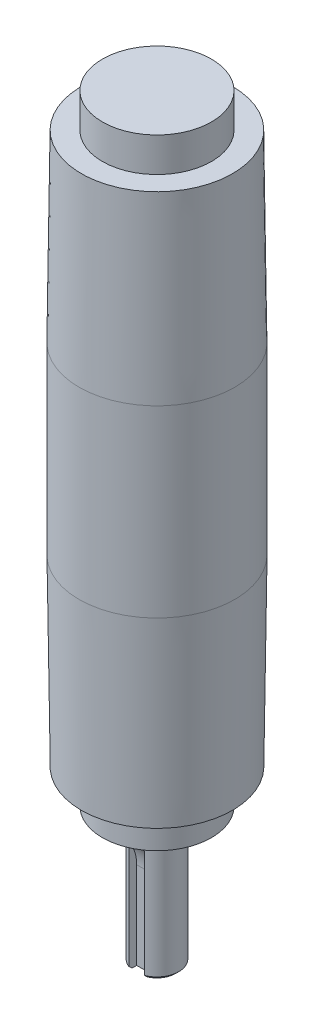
ISO-10303-21;
HEADER;
FILE_DESCRIPTION(('STEP AP214'),'2;1');
FILE_NAME('part.step','',(''),(''),'','','');
FILE_SCHEMA(('AUTOMOTIVE_DESIGN { 1 0 10303 214 1 1 1 1 }'));
ENDSEC;
DATA;
#1=APPLICATION_CONTEXT('core data for automotive mechanical design processes');
#2=APPLICATION_PROTOCOL_DEFINITION('international standard','automotive_design',2000,#1);
#3=PRODUCT_CONTEXT('',#1,'mechanical');
#4=PRODUCT('Part','Part','',(#3));
#5=PRODUCT_RELATED_PRODUCT_CATEGORY('part','',(#4));
#6=PRODUCT_DEFINITION_FORMATION('','',#4);
#7=PRODUCT_DEFINITION_CONTEXT('part definition',#1,'design');
#8=PRODUCT_DEFINITION('design','',#6,#7);
#9=PRODUCT_DEFINITION_SHAPE('','',#8);
#10=(LENGTH_UNIT() NAMED_UNIT(*) SI_UNIT(.MILLI.,.METRE.));
#11=(NAMED_UNIT(*) PLANE_ANGLE_UNIT() SI_UNIT($,.RADIAN.));
#12=(NAMED_UNIT(*) SI_UNIT($,.STERADIAN.) SOLID_ANGLE_UNIT());
#13=UNCERTAINTY_MEASURE_WITH_UNIT(LENGTH_MEASURE(1.E-05),#10,'distance_accuracy_value','');
#14=(GEOMETRIC_REPRESENTATION_CONTEXT(3) GLOBAL_UNCERTAINTY_ASSIGNED_CONTEXT((#13)) GLOBAL_UNIT_ASSIGNED_CONTEXT((#10,
#11,#12)) REPRESENTATION_CONTEXT('',''));
#15=CARTESIAN_POINT('',(0.,0.,0.));
#16=DIRECTION('',(0.,0.,1.));
#17=DIRECTION('',(1.,0.,0.));
#18=AXIS2_PLACEMENT_3D('',#15,#16,#17);
#19=CARTESIAN_POINT('',(0.,-33.0000000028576,0.));
#20=DIRECTION('',(0.,-1.,0.));
#21=DIRECTION('',(0.,0.,-1.));
#22=AXIS2_PLACEMENT_3D('',#19,#20,#21);
#23=CONICAL_SURFACE('',#22,2.49999999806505,1.0471975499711);
#24=CARTESIAN_POINT('',(-1.4210854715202E-10,-31.5566243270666,0.));
#25=VERTEX_POINT('',#24);
#26=VERTEX_LOOP('',#25);
#27=FACE_BOUND('',#26,.T.);
#28=CARTESIAN_POINT('',(0.,-33.,0.));
#29=DIRECTION('',(0.,1.,0.));
#30=DIRECTION('',(-1.,0.,0.));
#31=AXIS2_PLACEMENT_3D('',#28,#29,#30);
#32=CIRCLE('',#31,2.5);
#33=CARTESIAN_POINT('',(-2.5,-33.,0.));
#34=VERTEX_POINT('',#33);
#35=EDGE_CURVE('E283',#34,#34,#32,.F.);
#36=ORIENTED_EDGE('',*,*,#35,.T.);
#37=EDGE_LOOP('',(#36));
#38=FACE_BOUND('',#37,.T.);
#39=ADVANCED_FACE('F16',(#27,#38),#23,.F.);
#40=CARTESIAN_POINT('',(0.,-38.,0.));
#41=DIRECTION('',(0.,1.,0.));
#42=DIRECTION('',(-1.,0.,0.));
#43=AXIS2_PLACEMENT_3D('',#40,#41,#42);
#44=CYLINDRICAL_SURFACE('',#43,2.5);
#45=CARTESIAN_POINT('',(0.,-38.,0.));
#46=DIRECTION('',(0.,1.,0.));
#47=DIRECTION('',(-1.,0.,0.));
#48=AXIS2_PLACEMENT_3D('',#45,#46,#47);
#49=CIRCLE('',#48,2.5);
#50=CARTESIAN_POINT('',(-2.5,-38.,0.));
#51=VERTEX_POINT('',#50);
#52=EDGE_CURVE('E19',#51,#51,#49,.F.);
#53=ORIENTED_EDGE('',*,*,#52,.T.);
#54=EDGE_LOOP('',(#53));
#55=FACE_BOUND('',#54,.T.);
#56=ORIENTED_EDGE('',*,*,#35,.F.);
#57=EDGE_LOOP('',(#56));
#58=FACE_BOUND('',#57,.T.);
#59=ADVANCED_FACE('F511',(#55,#58),#44,.F.);
#60=CARTESIAN_POINT('',(0.,-38.,0.));
#61=DIRECTION('',(0.,1.,0.));
#62=DIRECTION('',(0.,0.,1.));
#63=AXIS2_PLACEMENT_3D('',#60,#61,#62);
#64=PLANE('',#63);
#65=ORIENTED_EDGE('',*,*,#52,.F.);
#66=EDGE_LOOP('',(#65));
#67=FACE_BOUND('',#66,.T.);
#68=CARTESIAN_POINT('',(0.,-38.,0.));
#69=DIRECTION('',(0.,1.,0.));
#70=DIRECTION('',(-1.,0.,0.));
#71=AXIS2_PLACEMENT_3D('',#68,#69,#70);
#72=CIRCLE('',#71,3.);
#73=CARTESIAN_POINT('',(-3.,-38.,0.));
#74=VERTEX_POINT('',#73);
#75=EDGE_CURVE('E277',#74,#74,#72,.F.);
#76=ORIENTED_EDGE('',*,*,#75,.T.);
#77=EDGE_LOOP('',(#76));
#78=FACE_BOUND('',#77,.T.);
#79=ADVANCED_FACE('F501',(#67,#78),#64,.F.);
#80=CARTESIAN_POINT('',(0.,-53.,0.));
#81=DIRECTION('',(0.,1.,0.));
#82=DIRECTION('',(-1.,0.,0.));
#83=AXIS2_PLACEMENT_3D('',#80,#81,#82);
#84=CYLINDRICAL_SURFACE('',#83,3.);
#85=CARTESIAN_POINT('',(0.,-53.,0.));
#86=DIRECTION('',(0.,1.,0.));
#87=DIRECTION('',(-1.,0.,0.));
#88=AXIS2_PLACEMENT_3D('',#85,#86,#87);
#89=CIRCLE('',#88,3.);
#90=CARTESIAN_POINT('',(-3.,-53.,0.));
#91=VERTEX_POINT('',#90);
#92=EDGE_CURVE('E273',#91,#91,#89,.T.);
#93=ORIENTED_EDGE('',*,*,#92,.F.);
#94=EDGE_LOOP('',(#93));
#95=FACE_BOUND('',#94,.T.);
#96=ORIENTED_EDGE('',*,*,#75,.F.);
#97=EDGE_LOOP('',(#96));
#98=FACE_BOUND('',#97,.T.);
#99=ADVANCED_FACE('F491',(#95,#98),#84,.F.);
#100=CARTESIAN_POINT('',(0.,-53.,-0.272821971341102));
#101=DIRECTION('',(0.,-1.,0.));
#102=DIRECTION('',(0.,0.,-1.));
#103=AXIS2_PLACEMENT_3D('',#100,#101,#102);
#104=PLANE('',#103);
#105=ORIENTED_EDGE('',*,*,#92,.T.);
#106=EDGE_LOOP('',(#105));
#107=FACE_BOUND('',#106,.T.);
#108=DIRECTION('',(0.,0.,-1.));
#109=VECTOR('',#108,1.);
#110=CARTESIAN_POINT('',(-2.5,-53.,-0.272821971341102));
#111=LINE('',#110,#109);
#112=CARTESIAN_POINT('',(-2.5,-53.,4.));
#113=VERTEX_POINT('',#112);
#114=CARTESIAN_POINT('',(-2.5,-52.9999999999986,5.45435605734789));
#115=VERTEX_POINT('',#114);
#116=EDGE_CURVE('E276',#113,#115,#111,.F.);
#117=ORIENTED_EDGE('',*,*,#116,.T.);
#118=CARTESIAN_POINT('',(0.,-52.9999999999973,0.));
#119=DIRECTION('',(0.,1.,0.));
#120=DIRECTION('',(0.,0.,1.));
#121=AXIS2_PLACEMENT_3D('',#118,#119,#120);
#122=CIRCLE('',#121,6.00000000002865);
#123=CARTESIAN_POINT('',(2.5,-52.9999999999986,5.45435605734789));
#124=VERTEX_POINT('',#123);
#125=EDGE_CURVE('E98',#124,#115,#122,.T.);
#126=ORIENTED_EDGE('',*,*,#125,.F.);
#127=DIRECTION('',(0.,0.,-1.));
#128=VECTOR('',#127,1.);
#129=CARTESIAN_POINT('',(2.5,-53.,5.26917420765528));
#130=LINE('',#129,#128);
#131=CARTESIAN_POINT('',(2.5,-53.,4.));
#132=VERTEX_POINT('',#131);
#133=EDGE_CURVE('E94',#124,#132,#130,.T.);
#134=ORIENTED_EDGE('',*,*,#133,.T.);
#135=DIRECTION('',(-1.,0.,0.));
#136=VECTOR('',#135,1.);
#137=CARTESIAN_POINT('',(0.,-53.,4.));
#138=LINE('',#137,#136);
#139=EDGE_CURVE('E275',#132,#113,#138,.T.);
#140=ORIENTED_EDGE('',*,*,#139,.T.);
#141=EDGE_LOOP('',(#117,#126,#134,#140));
#142=FACE_BOUND('',#141,.T.);
#143=ADVANCED_FACE('F482',(#107,#142),#104,.T.);
#144=CARTESIAN_POINT('',(0.,-39.0000000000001,4.));
#145=DIRECTION('',(0.,0.,-1.));
#146=DIRECTION('',(-1.,0.,0.));
#147=AXIS2_PLACEMENT_3D('',#144,#145,#146);
#148=PLANE('',#147);
#149=ORIENTED_EDGE('',*,*,#139,.F.);
#150=DIRECTION('',(0.,1.,0.));
#151=VECTOR('',#150,1.);
#152=CARTESIAN_POINT('',(2.5,-35.2245696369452,4.));
#153=LINE('',#152,#151);
#154=CARTESIAN_POINT('',(2.5,-25.0000000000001,3.99999999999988));
#155=VERTEX_POINT('',#154);
#156=EDGE_CURVE('E99',#132,#155,#153,.T.);
#157=ORIENTED_EDGE('',*,*,#156,.T.);
#158=DIRECTION('',(-1.,0.,0.));
#159=VECTOR('',#158,1.);
#160=CARTESIAN_POINT('',(2.5,-25.0000000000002,3.99999999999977));
#161=LINE('',#160,#159);
#162=CARTESIAN_POINT('',(-2.5,-25.0000000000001,3.99999999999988));
#163=VERTEX_POINT('',#162);
#164=EDGE_CURVE('E117',#155,#163,#161,.T.);
#165=ORIENTED_EDGE('',*,*,#164,.T.);
#166=DIRECTION('',(0.,1.,0.));
#167=VECTOR('',#166,1.);
#168=CARTESIAN_POINT('',(-2.5,-35.2245696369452,4.));
#169=LINE('',#168,#167);
#170=EDGE_CURVE('E255',#113,#163,#169,.T.);
#171=ORIENTED_EDGE('',*,*,#170,.F.);
#172=EDGE_LOOP('',(#149,#157,#165,#171));
#173=FACE_BOUND('',#172,.T.);
#174=ADVANCED_FACE('F474',(#173),#148,.F.);
#175=CARTESIAN_POINT('',(2.5,-35.2245696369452,5.26917420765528));
#176=DIRECTION('',(1.,0.,0.));
#177=DIRECTION('',(0.,0.,-1.));
#178=AXIS2_PLACEMENT_3D('',#175,#176,#177);
#179=PLANE('',#178);
#180=DIRECTION('',(0.,-1.,0.));
#181=VECTOR('',#180,1.);
#182=CARTESIAN_POINT('',(2.50000000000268,-15.4999999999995,6.53834841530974));
#183=LINE('',#182,#181);
#184=CARTESIAN_POINT('',(2.50000000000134,-17.4491392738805,6.53834841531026));
#185=VERTEX_POINT('',#184);
#186=CARTESIAN_POINT('',(2.50000000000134,-51.9999999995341,6.5383484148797));
#187=VERTEX_POINT('',#186);
#188=EDGE_CURVE('E91',#185,#187,#183,.T.);
#189=ORIENTED_EDGE('',*,*,#188,.F.);
#190=CARTESIAN_POINT('',(2.5,-25.,16.4999999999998));
#191=DIRECTION('',(-1.,0.,0.));
#192=DIRECTION('',(0.,0.,1.));
#193=AXIS2_PLACEMENT_3D('',#190,#191,#192);
#194=CIRCLE('',#193,12.5);
#195=EDGE_CURVE('E253',#185,#155,#194,.T.);
#196=ORIENTED_EDGE('',*,*,#195,.T.);
#197=ORIENTED_EDGE('',*,*,#156,.F.);
#198=ORIENTED_EDGE('',*,*,#133,.F.);
#199=CARTESIAN_POINT('',(2.50000000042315,-51.9999999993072,6.5383484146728));
#200=CARTESIAN_POINT('',(2.5000000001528,-52.0838915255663,6.44853197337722));
#201=CARTESIAN_POINT('',(2.50000000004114,-52.1676669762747,6.35860693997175));
#202=CARTESIAN_POINT('',(2.49999999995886,-52.3349509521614,6.17851085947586));
#203=CARTESIAN_POINT('',(2.49999999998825,-52.4184594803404,6.08833981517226));
#204=CARTESIAN_POINT('',(2.50000000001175,-52.5851769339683,5.90772063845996));
#205=CARTESIAN_POINT('',(2.50000000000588,-52.6683858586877,5.81727250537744));
#206=CARTESIAN_POINT('',(2.49999999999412,-52.83446108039,5.636060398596));
#207=CARTESIAN_POINT('',(2.49999999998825,-52.9173273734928,5.54529642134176));
#208=CARTESIAN_POINT('',(2.5,-53.0000000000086,5.45435605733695));
#209=B_SPLINE_CURVE_WITH_KNOTS('',3,(#199,#200,#201,#202,#203,#204,#205,#206,#207,#208),
.UNSPECIFIED.,.F.,.F.,(4,2,2,2,4),(0.,0.368704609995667,0.737405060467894,1.1061064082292,
1.47481191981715),.UNSPECIFIED.);
#210=EDGE_CURVE('E86',#187,#124,#209,.T.);
#211=ORIENTED_EDGE('',*,*,#210,.F.);
#212=EDGE_LOOP('',(#189,#196,#197,#198,#211));
#213=FACE_BOUND('',#212,.T.);
#214=ADVANCED_FACE('F88',(#213),#179,.F.);
#215=CARTESIAN_POINT('',(0.,-51.9999999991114,0.));
#216=DIRECTION('',(0.,1.,0.));
#217=DIRECTION('',(0.,0.,1.));
#218=AXIS2_PLACEMENT_3D('',#215,#216,#217);
#219=CONICAL_SURFACE('',#218,6.99999999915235,0.785398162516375);
#220=CARTESIAN_POINT('',(-2.50000000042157,-51.9999999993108,6.53834841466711));
#221=CARTESIAN_POINT('',(-2.50000000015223,-52.0838915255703,6.44853197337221));
#222=CARTESIAN_POINT('',(-2.50000000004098,-52.1676669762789,6.3586069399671));
#223=CARTESIAN_POINT('',(-2.49999999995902,-52.3349509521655,6.17851085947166));
#224=CARTESIAN_POINT('',(-2.49999999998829,-52.4184594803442,6.08833981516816));
#225=CARTESIAN_POINT('',(-2.50000000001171,-52.5851769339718,5.90772063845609));
#226=CARTESIAN_POINT('',(-2.50000000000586,-52.6683858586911,5.81727250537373));
#227=CARTESIAN_POINT('',(-2.49999999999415,-52.8344610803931,5.63606039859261));
#228=CARTESIAN_POINT('',(-2.49999999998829,-52.9173273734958,5.54529642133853));
#229=CARTESIAN_POINT('',(-2.5,-53.0000000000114,5.45435605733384));
#230=B_SPLINE_CURVE_WITH_KNOTS('',3,(#220,#221,#222,#223,#224,#225,#226,#227,#228,#229),
.UNSPECIFIED.,.F.,.F.,(4,2,2,2,4),(0.,0.368704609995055,0.737405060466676,1.10610640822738,
1.4748119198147),.UNSPECIFIED.);
#231=CARTESIAN_POINT('',(-2.5,-51.9999999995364,6.53834841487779));
#232=VERTEX_POINT('',#231);
#233=EDGE_CURVE('E105',#232,#115,#230,.T.);
#234=ORIENTED_EDGE('',*,*,#233,.F.);
#235=CARTESIAN_POINT('',(0.,-52.,0.));
#236=DIRECTION('',(0.,-1.,0.));
#237=DIRECTION('',(1.,0.,0.));
#238=AXIS2_PLACEMENT_3D('',#235,#236,#237);
#239=CIRCLE('',#238,6.99999999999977);
#240=EDGE_CURVE('E102',#187,#232,#239,.F.);
#241=ORIENTED_EDGE('',*,*,#240,.F.);
#242=ORIENTED_EDGE('',*,*,#210,.T.);
#243=ORIENTED_EDGE('',*,*,#125,.T.);
#244=EDGE_LOOP('',(#234,#241,#242,#243));
#245=FACE_BOUND('',#244,.T.);
#246=ADVANCED_FACE('F103',(#245),#219,.T.);
#247=CARTESIAN_POINT('',(-2.5,-35.2245696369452,5.26917420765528));
#248=DIRECTION('',(1.,0.,0.));
#249=DIRECTION('',(0.,0.,-1.));
#250=AXIS2_PLACEMENT_3D('',#247,#248,#249);
#251=PLANE('',#250);
#252=CARTESIAN_POINT('',(-2.5,-25.,16.4999999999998));
#253=DIRECTION('',(-1.,0.,0.));
#254=DIRECTION('',(0.,0.,1.));
#255=AXIS2_PLACEMENT_3D('',#252,#253,#254);
#256=CIRCLE('',#255,12.5);
#257=CARTESIAN_POINT('',(-2.50000000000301,-17.4491392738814,6.53834841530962));
#258=VERTEX_POINT('',#257);
#259=EDGE_CURVE('E115',#163,#258,#256,.F.);
#260=ORIENTED_EDGE('',*,*,#259,.T.);
#261=DIRECTION('',(0.,-1.,0.));
#262=VECTOR('',#261,1.);
#263=CARTESIAN_POINT('',(-2.49999999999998,-15.4999999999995,6.53834841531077));
#264=LINE('',#263,#262);
#265=EDGE_CURVE('E109',#232,#258,#264,.F.);
#266=ORIENTED_EDGE('',*,*,#265,.F.);
#267=ORIENTED_EDGE('',*,*,#233,.T.);
#268=ORIENTED_EDGE('',*,*,#116,.F.);
#269=ORIENTED_EDGE('',*,*,#170,.T.);
#270=EDGE_LOOP('',(#260,#266,#267,#268,#269));
#271=FACE_BOUND('',#270,.T.);
#272=ADVANCED_FACE('F261',(#271),#251,.T.);
#273=CARTESIAN_POINT('',(2.5,-25.,16.4999999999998));
#274=DIRECTION('',(-1.,0.,0.));
#275=DIRECTION('',(0.,0.,1.));
#276=AXIS2_PLACEMENT_3D('',#273,#274,#275);
#277=CYLINDRICAL_SURFACE('',#276,12.5);
#278=ORIENTED_EDGE('',*,*,#259,.F.);
#279=ORIENTED_EDGE('',*,*,#164,.F.);
#280=ORIENTED_EDGE('',*,*,#195,.F.);
#281=CARTESIAN_POINT('',(-2.50000000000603,-17.4491392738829,6.53834841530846));
#282=CARTESIAN_POINT('',(-2.38963014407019,-17.3934443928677,6.58057075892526));
#283=CARTESIAN_POINT('',(-2.27647257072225,-17.3415805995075,6.62061330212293));
#284=CARTESIAN_POINT('',(-2.04521693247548,-17.2457394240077,6.69565493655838));
#285=CARTESIAN_POINT('',(-1.92711758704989,-17.2017641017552,6.7306527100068));
#286=CARTESIAN_POINT('',(-1.68661830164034,-17.1219357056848,6.79491245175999));
#287=CARTESIAN_POINT('',(-1.56421647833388,-17.0860862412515,6.82417187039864));
#288=CARTESIAN_POINT('',(-1.31596954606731,-17.0227065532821,6.87635835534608));
#289=CARTESIAN_POINT('',(-1.19012482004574,-16.9951754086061,6.89928612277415));
#290=CARTESIAN_POINT('',(-0.935588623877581,-16.9485040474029,6.93839223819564));
#291=CARTESIAN_POINT('',(-0.806891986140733,-16.9293806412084,6.9545570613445));
#292=CARTESIAN_POINT('',(-0.547821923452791,-16.8996846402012,6.9797441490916));
#293=CARTESIAN_POINT('',(-0.417448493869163,-16.8891120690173,6.98876639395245));
#294=CARTESIAN_POINT('',(-0.156071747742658,-16.876563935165,6.9994813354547));
#295=CARTESIAN_POINT('',(-0.0250688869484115,-16.8745828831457,7.00117871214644));
#296=CARTESIAN_POINT('',(0.236667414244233,-16.8792105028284,6.99722212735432));
#297=CARTESIAN_POINT('',(0.367400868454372,-16.8858187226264,6.99156855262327));
#298=CARTESIAN_POINT('',(0.625048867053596,-16.9073815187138,6.97321036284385));
#299=CARTESIAN_POINT('',(0.751987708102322,-16.9221678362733,6.96064792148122));
#300=CARTESIAN_POINT('',(1.00379102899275,-16.9599087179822,6.9288171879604));
#301=CARTESIAN_POINT('',(1.12865552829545,-16.9828632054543,6.90954895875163));
#302=CARTESIAN_POINT('',(1.3754222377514,-17.0368357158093,6.86468766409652));
#303=CARTESIAN_POINT('',(1.49732539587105,-17.0678511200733,6.83909665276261));
#304=CARTESIAN_POINT('',(1.73739130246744,-17.1378009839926,6.78208567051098));
#305=CARTESIAN_POINT('',(1.85555542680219,-17.1767324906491,6.75066787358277));
#306=CARTESIAN_POINT('',(2.06260452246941,-17.2531517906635,6.68989362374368));
#307=CARTESIAN_POINT('',(2.15233597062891,-17.2891600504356,6.66153902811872));
#308=CARTESIAN_POINT('',(2.32858416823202,-17.3657449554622,6.60199574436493));
#309=CARTESIAN_POINT('',(2.41510805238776,-17.4063105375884,6.57081395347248));
#310=CARTESIAN_POINT('',(2.50000000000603,-17.4491392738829,6.53834841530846));
#311=B_SPLINE_CURVE_WITH_KNOTS('',3,(#281,#282,#283,#284,#285,#286,#287,#288,#289,#290,#291,
#292,#293,#294,#295,#296,#297,#298,#299,#300,#301,#302,#303,#304,#305,#306,#307,#308,#309,#310),
.UNSPECIFIED.,.F.,.F.,(4,2,2,2,2,2,2,2,2,2,2,2,2,2,4),(0.,0.39183588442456,0.783773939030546,
1.17588574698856,1.5679541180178,1.96080286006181,2.35365268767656,2.74625147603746,
3.13882960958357,3.52361598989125,3.90839875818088,4.29305668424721,4.67757138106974,
4.97965905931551,5.28102863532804),.UNSPECIFIED.);
#312=EDGE_CURVE('E114',#258,#185,#311,.T.);
#313=ORIENTED_EDGE('',*,*,#312,.F.);
#314=EDGE_LOOP('',(#278,#279,#280,#313));
#315=FACE_BOUND('',#314,.T.);
#316=ADVANCED_FACE('F205',(#315),#277,.F.);
#317=CARTESIAN_POINT('',(0.,-15.4999999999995,0.));
#318=DIRECTION('',(0.,-1.,0.));
#319=DIRECTION('',(1.,0.,0.));
#320=AXIS2_PLACEMENT_3D('',#317,#318,#319);
#321=CYLINDRICAL_SURFACE('',#320,6.99999999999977);
#322=CARTESIAN_POINT('',(0.,-15.4999999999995,0.));
#323=DIRECTION('',(0.,1.,0.));
#324=DIRECTION('',(0.,0.,1.));
#325=AXIS2_PLACEMENT_3D('',#322,#323,#324);
#326=CIRCLE('',#325,6.99999999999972);
#327=CARTESIAN_POINT('',(-6.54856536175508,-15.4999999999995,2.47311376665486));
#328=VERTEX_POINT('',#327);
#329=CARTESIAN_POINT('',(0.,-15.4999999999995,6.99999999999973));
#330=VERTEX_POINT('',#329);
#331=EDGE_CURVE('E222',#328,#330,#326,.T.);
#332=ORIENTED_EDGE('',*,*,#331,.F.);
#333=CARTESIAN_POINT('',(-0.157133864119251,-15.4999999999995,6.99999999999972));
#334=CARTESIAN_POINT('',(-0.07893390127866,-15.4999999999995,6.99999999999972));
#335=CARTESIAN_POINT('',(6.99999999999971,-15.4999999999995,6.99999999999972));
#336=CARTESIAN_POINT('',(6.99999999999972,-15.4999999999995,0.));
#337=CARTESIAN_POINT('',(6.99999999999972,-15.4999999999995,-6.99999999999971));
#338=CARTESIAN_POINT('',(0.,-15.4999999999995,-6.99999999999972));
#339=CARTESIAN_POINT('',(-6.99999999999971,-15.4999999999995,-6.99999999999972));
#340=CARTESIAN_POINT('',(-6.99999999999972,-15.4999999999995,0.));
#341=CARTESIAN_POINT('',(-6.99999999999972,-15.4999999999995,1.27775859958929));
#342=CARTESIAN_POINT('',(-6.50744409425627,-15.4999999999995,2.58199889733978));
#343=CARTESIAN_POINT('',(-6.46602720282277,-15.4999999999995,2.69166681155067));
#344=(BOUNDED_CURVE() B_SPLINE_CURVE(2,(#333,#334,#335,#336,#337,#338,#339,#340,#341,#342,#343),
.UNSPECIFIED.,.F.,.F.) B_SPLINE_CURVE_WITH_KNOTS((3,1,1,1,1,1,1,1,1,3),(0.377081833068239,
0.576477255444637,13.0216637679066,13.1037250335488,25.5489115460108,25.6312438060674,
38.117528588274,38.1688275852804,40.4555625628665,40.6549580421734),
.UNSPECIFIED.) CURVE() GEOMETRIC_REPRESENTATION_ITEM() RATIONAL_B_SPLINE_CURVE((1.00938540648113,
1.00469270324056,0.707106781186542,0.999999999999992,0.707106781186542,0.999999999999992,
0.707106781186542,0.999999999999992,0.92970562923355,0.889965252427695,0.886777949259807)) REPRESENTATION_ITEM(''));
#345=CARTESIAN_POINT('',(-6.99999999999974,-15.4999999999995,0.));
#346=VERTEX_POINT('',#345);
#347=EDGE_CURVE('E127',#346,#328,#344,.T.);
#348=ORIENTED_EDGE('',*,*,#347,.F.);
#349=CARTESIAN_POINT('',(-0.157133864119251,-15.4999999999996,6.99999999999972));
#350=CARTESIAN_POINT('',(-0.07893390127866,-15.4999999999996,6.99999999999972));
#351=CARTESIAN_POINT('',(6.99999999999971,-15.4999999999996,6.99999999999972));
#352=CARTESIAN_POINT('',(6.99999999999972,-15.4999999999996,0.));
#353=CARTESIAN_POINT('',(6.99999999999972,-15.4999999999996,-6.99999999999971));
#354=CARTESIAN_POINT('',(0.,-15.4999999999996,-6.99999999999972));
#355=CARTESIAN_POINT('',(-6.99999999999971,-15.4999999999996,-6.99999999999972));
#356=CARTESIAN_POINT('',(-6.99999999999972,-15.4999999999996,0.));
#357=CARTESIAN_POINT('',(-6.99999999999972,-15.4999999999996,1.27775859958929));
#358=CARTESIAN_POINT('',(-6.50744409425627,-15.4999999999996,2.58199889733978));
#359=CARTESIAN_POINT('',(-6.46602720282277,-15.4999999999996,2.69166681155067));
#360=(BOUNDED_CURVE() B_SPLINE_CURVE(2,(#349,#350,#351,#352,#353,#354,#355,#356,#357,#358,#359),
.UNSPECIFIED.,.F.,.F.) B_SPLINE_CURVE_WITH_KNOTS((3,1,1,1,1,1,1,1,1,3),(0.377081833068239,
0.576477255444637,13.0216637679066,13.1037250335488,25.5489115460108,25.6312438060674,
38.117528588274,38.1688275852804,40.4555625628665,40.6549580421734),
.UNSPECIFIED.) CURVE() GEOMETRIC_REPRESENTATION_ITEM() RATIONAL_B_SPLINE_CURVE((1.00938540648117,
1.00469270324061,0.707106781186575,1.00000000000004,0.707106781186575,1.00000000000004,
0.707106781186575,1.00000000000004,0.929705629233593,0.889965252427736,0.886777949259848)) REPRESENTATION_ITEM(''));
#361=CARTESIAN_POINT('',(6.99999999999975,-15.4999999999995,0.));
#362=VERTEX_POINT('',#361);
#363=EDGE_CURVE('E221',#362,#346,#360,.T.);
#364=ORIENTED_EDGE('',*,*,#363,.F.);
#365=CARTESIAN_POINT('',(-0.157133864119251,-15.4999999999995,6.99999999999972));
#366=CARTESIAN_POINT('',(-0.07893390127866,-15.4999999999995,6.99999999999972));
#367=CARTESIAN_POINT('',(6.99999999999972,-15.4999999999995,6.99999999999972));
#368=CARTESIAN_POINT('',(6.99999999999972,-15.4999999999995,0.));
#369=CARTESIAN_POINT('',(6.99999999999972,-15.4999999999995,-6.99999999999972));
#370=CARTESIAN_POINT('',(0.,-15.4999999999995,-6.99999999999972));
#371=CARTESIAN_POINT('',(-6.99999999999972,-15.4999999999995,-6.99999999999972));
#372=CARTESIAN_POINT('',(-6.99999999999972,-15.4999999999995,0.));
#373=CARTESIAN_POINT('',(-6.99999999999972,-15.4999999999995,1.27775859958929));
#374=CARTESIAN_POINT('',(-6.50744409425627,-15.4999999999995,2.58199889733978));
#375=CARTESIAN_POINT('',(-6.46602720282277,-15.4999999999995,2.69166681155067));
#376=(BOUNDED_CURVE() B_SPLINE_CURVE(2,(#365,#366,#367,#368,#369,#370,#371,#372,#373,#374,#375),
.UNSPECIFIED.,.F.,.F.) B_SPLINE_CURVE_WITH_KNOTS((3,1,1,1,1,1,1,1,1,3),(0.377081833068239,
0.576477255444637,13.0216637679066,13.1037250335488,25.5489115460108,25.6312438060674,
38.117528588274,38.1688275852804,40.4555625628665,40.6549580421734),
.UNSPECIFIED.) CURVE() GEOMETRIC_REPRESENTATION_ITEM() RATIONAL_B_SPLINE_CURVE((1.00938540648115,
1.00469270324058,0.707106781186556,1.00000000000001,0.707106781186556,1.00000000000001,
0.707106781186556,1.00000000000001,0.929705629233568,0.889965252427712,0.886777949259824)) REPRESENTATION_ITEM(''));
#377=EDGE_CURVE('E194',#330,#362,#376,.T.);
#378=ORIENTED_EDGE('',*,*,#377,.F.);
#379=EDGE_LOOP('',(#332,#348,#364,#378));
#380=FACE_BOUND('',#379,.T.);
#381=ORIENTED_EDGE('',*,*,#265,.T.);
#382=ORIENTED_EDGE('',*,*,#312,.T.);
#383=ORIENTED_EDGE('',*,*,#188,.T.);
#384=ORIENTED_EDGE('',*,*,#240,.T.);
#385=EDGE_LOOP('',(#381,#382,#383,#384));
#386=FACE_BOUND('',#385,.T.);
#387=ADVANCED_FACE('F112',(#380,#386),#321,.T.);
#388=CARTESIAN_POINT('',(0.,-15.4999999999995,6.99999999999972));
#389=CARTESIAN_POINT('',(-4.83895355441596,-15.4999999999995,6.99999999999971));
#390=CARTESIAN_POINT('',(-6.54856536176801,-15.4999999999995,2.4731137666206));
#391=CARTESIAN_POINT('',(0.,-14.9999999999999,7.00000000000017));
#392=CARTESIAN_POINT('',(-4.83895355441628,-14.9999999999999,7.00000000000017));
#393=CARTESIAN_POINT('',(-6.54856536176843,-14.9999999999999,2.47311376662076));
#394=CARTESIAN_POINT('',(0.,-14.9999999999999,7.49999999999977));
#395=CARTESIAN_POINT('',(-5.18459309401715,-14.9999999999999,7.49999999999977));
#396=CARTESIAN_POINT('',(-7.01632003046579,-14.9999999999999,2.64976474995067));
#397=CARTESIAN_POINT('',(0.,-14.9999999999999,7.5181574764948));
#398=CARTESIAN_POINT('',(-5.19714497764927,-14.9999999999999,7.5181574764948));
#399=CARTESIAN_POINT('',(-7.03330651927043,-14.9999999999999,2.65617982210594));
#400=CARTESIAN_POINT('',(0.,-15.0013170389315,7.53626712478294));
#401=CARTESIAN_POINT('',(-5.20966379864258,-15.0013170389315,7.53626712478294));
#402=CARTESIAN_POINT('',(-7.05024826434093,-15.0013170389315,2.66257799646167));
#403=(BOUNDED_SURFACE() B_SPLINE_SURFACE(2,2,((#388,#389,#390),(#391,#392,#393),(#394,#395,
#396),(#397,#398,#399),(#400,#401,#402)),.UNSPECIFIED.,.F.,.F.,
.F.) B_SPLINE_SURFACE_WITH_KNOTS((3,1,1,3),(3,3),(0.,1.01370529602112,1.04622621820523,
1.08303887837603),(0.,9.39687161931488),
.UNSPECIFIED.) GEOMETRIC_REPRESENTATION_ITEM() RATIONAL_B_SPLINE_SURFACE(((1.,0.777401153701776,
0.893152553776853),(0.707106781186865,0.549705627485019,0.631554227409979),(1.,
0.777401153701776,0.893152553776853),(0.985180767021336,0.765880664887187,0.879916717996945),
(0.971861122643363,0.755525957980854,0.868020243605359))) REPRESENTATION_ITEM('') SURFACE());
#404=CARTESIAN_POINT('',(0.,-15.0013077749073,7.53613951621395));
#405=CARTESIAN_POINT('',(0.,-14.9999999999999,7.51809342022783));
#406=CARTESIAN_POINT('',(0.,-14.9999999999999,7.49999999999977));
#407=CARTESIAN_POINT('',(0.,-14.9999999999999,7.00000000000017));
#408=CARTESIAN_POINT('',(0.,-15.501790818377,6.99999999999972));
#409=CARTESIAN_POINT('',(0.,-15.5035763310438,6.99999999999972));
#410=(BOUNDED_CURVE() B_SPLINE_CURVE(2,(#404,#405,#406,#407,#408,#409),.UNSPECIFIED.,.F.,
.F.) B_SPLINE_CURVE_WITH_KNOTS((3,1,1,1,3),(0.,0.036763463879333,0.064607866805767,
1.08054248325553,1.08569604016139),
.UNSPECIFIED.) CURVE() GEOMETRIC_REPRESENTATION_ITEM() RATIONAL_B_SPLINE_CURVE((0.971953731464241,
0.985232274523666,1.,0.707106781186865,1.00148576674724,1.00297153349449)) REPRESENTATION_ITEM(''));
#411=CARTESIAN_POINT('',(0.,-14.9999999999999,7.4999999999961));
#412=VERTEX_POINT('',#411);
#413=EDGE_CURVE('E34',#412,#330,#410,.T.);
#414=CARTESIAN_POINT('',(0.,-14.9999999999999,0.));
#415=DIRECTION('',(0.,-1.,0.));
#416=DIRECTION('',(1.,0.,0.));
#417=AXIS2_PLACEMENT_3D('',#414,#415,#416);
#418=CIRCLE('',#417,7.5);
#419=CARTESIAN_POINT('',(-7.01632002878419,-14.9999999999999,2.64976474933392));
#420=VERTEX_POINT('',#419);
#421=EDGE_CURVE('E236',#420,#412,#418,.F.);
#422=CARTESIAN_POINT('',(-6.54856536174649,-15.5035763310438,2.47311376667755));
#423=CARTESIAN_POINT('',(-6.54856536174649,-15.501790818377,2.47311376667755));
#424=CARTESIAN_POINT('',(-6.54856536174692,-14.9999999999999,2.47311376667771));
#425=CARTESIAN_POINT('',(-7.01632003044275,-14.9999999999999,2.64976475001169));
#426=CARTESIAN_POINT('',(-7.03324659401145,-14.9999999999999,2.65615719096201));
#427=CARTESIAN_POINT('',(-7.05012888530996,-15.0013077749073,2.6625329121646));
#428=(BOUNDED_CURVE() B_SPLINE_CURVE(2,(#422,#423,#424,#425,#426,#427),.UNSPECIFIED.,.F.,
.F.) B_SPLINE_CURVE_WITH_KNOTS((3,1,1,1,3),(0.,0.005153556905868,1.02108817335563,
1.04893257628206,1.08569604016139),
.UNSPECIFIED.) CURVE() GEOMETRIC_REPRESENTATION_ITEM() RATIONAL_B_SPLINE_CURVE((0.895806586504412,
0.894479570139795,0.631554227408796,0.89315255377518,0.87996272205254,0.868102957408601)) REPRESENTATION_ITEM(''));
#429=EDGE_CURVE('E234',#328,#420,#428,.T.);
#430=ORIENTED_EDGE('',*,*,#331,.T.);
#431=ORIENTED_EDGE('',*,*,#413,.F.);
#432=ORIENTED_EDGE('',*,*,#421,.F.);
#433=ORIENTED_EDGE('',*,*,#429,.F.);
#434=EDGE_LOOP('',(#430,#431,#432,#433));
#435=FACE_BOUND('',#434,.T.);
#436=ADVANCED_FACE('F146',(#435),#403,.T.);
#437=CARTESIAN_POINT('',(-6.46602720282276,-15.5035763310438,2.69166681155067));
#438=CARTESIAN_POINT('',(-6.50744409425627,-15.5035763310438,2.58199889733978));
#439=CARTESIAN_POINT('',(-6.99999999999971,-15.5035763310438,1.27775859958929));
#440=CARTESIAN_POINT('',(-6.99999999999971,-15.5035763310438,0.));
#441=CARTESIAN_POINT('',(-6.99999999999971,-15.5035763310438,-6.99999999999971));
#442=CARTESIAN_POINT('',(0.,-15.5035763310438,-6.99999999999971));
#443=CARTESIAN_POINT('',(6.99999999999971,-15.5035763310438,-6.99999999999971));
#444=CARTESIAN_POINT('',(6.99999999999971,-15.5035763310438,0.));
#445=CARTESIAN_POINT('',(6.99999999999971,-15.5035763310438,6.99999999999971));
#446=CARTESIAN_POINT('',(-0.07893390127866,-15.5035763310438,6.99999999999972));
#447=CARTESIAN_POINT('',(-0.157133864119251,-15.5035763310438,6.99999999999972));
#448=CARTESIAN_POINT('',(-6.46602720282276,-15.501790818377,2.69166681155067));
#449=CARTESIAN_POINT('',(-6.50744409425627,-15.501790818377,2.58199889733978));
#450=CARTESIAN_POINT('',(-6.99999999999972,-15.501790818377,1.27775859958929));
#451=CARTESIAN_POINT('',(-6.99999999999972,-15.501790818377,0.));
#452=CARTESIAN_POINT('',(-6.99999999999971,-15.501790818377,-6.99999999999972));
#453=CARTESIAN_POINT('',(0.,-15.501790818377,-6.99999999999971));
#454=CARTESIAN_POINT('',(6.99999999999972,-15.501790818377,-6.99999999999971));
#455=CARTESIAN_POINT('',(6.99999999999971,-15.501790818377,0.));
#456=CARTESIAN_POINT('',(6.99999999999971,-15.501790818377,6.99999999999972));
#457=CARTESIAN_POINT('',(-0.07893390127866,-15.501790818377,6.99999999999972));
#458=CARTESIAN_POINT('',(-0.157133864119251,-15.501790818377,6.99999999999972));
#459=CARTESIAN_POINT('',(-6.46602720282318,-14.9999999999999,2.69166681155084));
#460=CARTESIAN_POINT('',(-6.50744409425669,-14.9999999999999,2.58199889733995));
#461=CARTESIAN_POINT('',(-7.00000000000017,-14.9999999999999,1.27775859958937));
#462=CARTESIAN_POINT('',(-7.00000000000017,-14.9999999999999,0.));
#463=CARTESIAN_POINT('',(-7.00000000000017,-14.9999999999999,-7.00000000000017));
#464=CARTESIAN_POINT('',(0.,-14.9999999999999,-7.00000000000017));
#465=CARTESIAN_POINT('',(7.00000000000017,-14.9999999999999,-7.00000000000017));
#466=CARTESIAN_POINT('',(7.00000000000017,-14.9999999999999,0.));
#467=CARTESIAN_POINT('',(7.00000000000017,-14.9999999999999,7.00000000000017));
#468=CARTESIAN_POINT('',(-0.078933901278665,-14.9999999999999,7.00000000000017));
#469=CARTESIAN_POINT('',(-0.157133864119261,-14.9999999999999,7.00000000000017));
#470=CARTESIAN_POINT('',(-6.92788628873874,-14.9999999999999,2.88392872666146));
#471=CARTESIAN_POINT('',(-6.97226152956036,-14.9999999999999,2.76642739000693));
#472=CARTESIAN_POINT('',(-7.49999999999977,-14.9999999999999,1.36902707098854));
#473=CARTESIAN_POINT('',(-7.49999999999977,-14.9999999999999,0.));
#474=CARTESIAN_POINT('',(-7.49999999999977,-14.9999999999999,-7.49999999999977));
#475=CARTESIAN_POINT('',(0.,-14.9999999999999,-7.49999999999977));
#476=CARTESIAN_POINT('',(7.49999999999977,-14.9999999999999,-7.49999999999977));
#477=CARTESIAN_POINT('',(7.49999999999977,-14.9999999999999,0.));
#478=CARTESIAN_POINT('',(7.49999999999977,-14.9999999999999,7.49999999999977));
#479=CARTESIAN_POINT('',(-0.084572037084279,-14.9999999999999,7.49999999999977));
#480=CARTESIAN_POINT('',(-0.168357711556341,-14.9999999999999,7.49999999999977));
#481=CARTESIAN_POINT('',(-6.94459950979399,-14.9999999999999,2.89088607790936));
#482=CARTESIAN_POINT('',(-6.98908180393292,-14.9999999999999,2.77310127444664));
#483=CARTESIAN_POINT('',(-7.51809342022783,-14.9999999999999,1.37232978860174));
#484=CARTESIAN_POINT('',(-7.51809342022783,-14.9999999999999,0.));
#485=CARTESIAN_POINT('',(-7.51809342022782,-14.9999999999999,-7.51809342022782));
#486=CARTESIAN_POINT('',(0.,-14.9999999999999,-7.51809342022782));
#487=CARTESIAN_POINT('',(7.51809342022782,-14.9999999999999,-7.51809342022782));
#488=CARTESIAN_POINT('',(7.51809342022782,-14.9999999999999,0.));
#489=CARTESIAN_POINT('',(7.51809342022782,-14.9999999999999,7.51809342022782));
#490=CARTESIAN_POINT('',(-0.084776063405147,-14.9999999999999,7.51809342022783));
#491=CARTESIAN_POINT('',(-0.168763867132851,-14.9999999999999,7.51809342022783));
#492=CARTESIAN_POINT('',(-6.961269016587,-15.0013077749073,2.89782523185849));
#493=CARTESIAN_POINT('',(-7.00585808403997,-15.0013077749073,2.77975770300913));
#494=CARTESIAN_POINT('',(-7.53613951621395,-15.0013077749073,1.37562386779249));
#495=CARTESIAN_POINT('',(-7.53613951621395,-15.0013077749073,0.));
#496=CARTESIAN_POINT('',(-7.53613951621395,-15.0013077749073,-7.53613951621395));
#497=CARTESIAN_POINT('',(0.,-15.0013077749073,-7.53613951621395));
#498=CARTESIAN_POINT('',(7.53613951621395,-15.0013077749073,-7.53613951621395));
#499=CARTESIAN_POINT('',(7.53613951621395,-15.0013077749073,0.));
#500=CARTESIAN_POINT('',(7.53613951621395,-15.0013077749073,7.53613951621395));
#501=CARTESIAN_POINT('',(-0.084979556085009,-15.0013077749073,7.53613951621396));
#502=CARTESIAN_POINT('',(-0.169168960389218,-15.0013077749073,7.53613951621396));
#503=(BOUNDED_SURFACE() B_SPLINE_SURFACE(2,2,((#437,#438,#439,#440,#441,#442,#443,#444,#445,
#446,#447),(#448,#449,#450,#451,#452,#453,#454,#455,#456,#457,#458),(#459,#460,#461,#462,#463,
#464,#465,#466,#467,#468,#469),(#470,#471,#472,#473,#474,#475,#476,#477,#478,#479,#480),(#481,
#482,#483,#484,#485,#486,#487,#488,#489,#490,#491),(#492,#493,#494,#495,#496,#497,#498,#499,
#500,#501,#502)),.UNSPECIFIED.,.F.,.F.,.F.) B_SPLINE_SURFACE_WITH_KNOTS((3,1,1,1,3),(3,1,1,1,1,
1,1,1,1,3),(0.,0.005153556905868,1.02108817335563,1.04893257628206,1.08569604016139),
(0.377081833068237,0.576477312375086,2.86321228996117,2.91451128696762,15.4007960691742,
15.4831283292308,27.9283148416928,28.010376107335,40.455562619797,40.6549580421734),
.UNSPECIFIED.) GEOMETRIC_REPRESENTATION_ITEM() RATIONAL_B_SPLINE_SURFACE(((0.889413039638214,
0.892609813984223,0.932468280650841,1.00297153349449,0.709207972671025,1.00297153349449,
0.709207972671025,1.00297153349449,0.709207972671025,1.00767818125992,1.01238482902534),
(0.888095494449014,0.891287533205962,0.931086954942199,1.00148576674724,0.708157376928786,
1.00148576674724,0.708157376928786,1.00148576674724,0.708157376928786,1.00618544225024,
1.01088511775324),(0.627046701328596,0.629300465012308,0.65740115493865,0.707106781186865,
0.500000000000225,0.707106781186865,0.500000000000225,0.707106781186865,0.500000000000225,
0.710425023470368,0.71374326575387),(0.886777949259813,0.889965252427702,0.929705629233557,1.,
0.707106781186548,1.,0.707106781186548,1.,0.707106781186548,1.00469270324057,1.00938540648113),
(0.873682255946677,0.876822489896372,0.915975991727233,0.985232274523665,0.69666442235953,
0.985232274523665,0.69666442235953,0.985232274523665,0.69666442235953,0.989855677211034,
0.994479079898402),(0.861907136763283,0.865005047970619,0.903630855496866,0.971953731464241,
0.687275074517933,0.971953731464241,0.687275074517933,0.971953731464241,0.687275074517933,
0.976514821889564,0.981075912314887))) REPRESENTATION_ITEM('') SURFACE());
#504=CARTESIAN_POINT('',(0.,-15.,0.));
#505=DIRECTION('',(0.,-1.,0.));
#506=DIRECTION('',(1.,0.,0.));
#507=AXIS2_PLACEMENT_3D('',#504,#505,#506);
#508=CIRCLE('',#507,7.5);
#509=CARTESIAN_POINT('',(-7.50000000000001,-15.,0.));
#510=VERTEX_POINT('',#509);
#511=EDGE_CURVE('E240',#510,#420,#508,.F.);
#512=CARTESIAN_POINT('',(7.49999999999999,-14.9999999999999,0.));
#513=CARTESIAN_POINT('',(7.50000822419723,-15.000000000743,-0.164802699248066));
#514=CARTESIAN_POINT('',(7.49456827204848,-15.0000000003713,-0.329603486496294));
#515=CARTESIAN_POINT('',(7.47286137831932,-14.9999999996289,-0.658348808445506));
#516=CARTESIAN_POINT('',(7.45660371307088,-14.9999999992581,-0.822293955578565));
#517=CARTESIAN_POINT('',(7.41333102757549,-15.0000000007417,-1.14875673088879));
#518=CARTESIAN_POINT('',(7.38631624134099,-15.0000000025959,-1.31127439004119));
#519=CARTESIAN_POINT('',(7.32162334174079,-14.9999999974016,-1.63431778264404));
#520=CARTESIAN_POINT('',(7.28393564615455,-14.9999999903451,-1.79484159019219));
#521=CARTESIAN_POINT('',(7.18612151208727,-15.0000000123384,-2.1573145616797));
#522=CARTESIAN_POINT('',(7.12266981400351,-15.0000000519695,-2.35837582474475));
#523=CARTESIAN_POINT('',(6.97904179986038,-15.0000037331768,-2.75452252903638));
#524=CARTESIAN_POINT('',(6.89885794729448,-15.0000073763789,-2.94960523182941));
#525=CARTESIAN_POINT('',(6.72224430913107,-15.0000159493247,-3.33255788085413));
#526=CARTESIAN_POINT('',(6.62579532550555,-15.0000208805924,-3.52041897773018));
#527=CARTESIAN_POINT('',(6.41736579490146,-15.0000307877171,-3.88741120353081));
#528=CARTESIAN_POINT('',(6.30537937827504,-15.0000357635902,-4.06653899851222));
#529=CARTESIAN_POINT('',(6.06684141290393,-15.0000444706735,-4.41450767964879));
#530=CARTESIAN_POINT('',(5.94030722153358,-15.0000482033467,-4.58336046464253));
#531=CARTESIAN_POINT('',(5.67340609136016,-15.0000536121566,-4.90988255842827));
#532=CARTESIAN_POINT('',(5.53303291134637,-15.0000552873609,-5.06754676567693));
#533=CARTESIAN_POINT('',(5.23951071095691,-15.000056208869,-5.37047526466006));
#534=CARTESIAN_POINT('',(5.08636259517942,-15.0000554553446,-5.51574043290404));
#535=CARTESIAN_POINT('',(4.76844327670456,-15.0000516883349,-5.79278737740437));
#536=CARTESIAN_POINT('',(4.60367736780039,-15.0000486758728,-5.92457522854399));
#537=CARTESIAN_POINT('',(4.26344607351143,-15.0000410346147,-6.17394211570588));
#538=CARTESIAN_POINT('',(4.08796921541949,-15.0000364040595,-6.29150549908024));
#539=CARTESIAN_POINT('',(3.72779587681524,-15.0000266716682,-6.51137761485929));
#540=CARTESIAN_POINT('',(3.54310287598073,-15.0000215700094,-6.61369204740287));
#541=CARTESIAN_POINT('',(3.16592235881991,-15.0000121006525,-6.80230513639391));
#542=CARTESIAN_POINT('',(2.97344207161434,-15.0000077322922,-6.8886182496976));
#543=CARTESIAN_POINT('',(2.58197001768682,-15.0000019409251,-7.04470140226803));
#544=CARTESIAN_POINT('',(2.38298070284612,-15.000000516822,-7.11447759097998));
#545=CARTESIAN_POINT('',(1.98245876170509,-14.9999994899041,-7.23623479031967));
#546=CARTESIAN_POINT('',(1.78099293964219,-14.9999998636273,-7.28843557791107));
#547=CARTESIAN_POINT('',(1.37462994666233,-15.0000001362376,-7.37587634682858));
#548=CARTESIAN_POINT('',(1.16973636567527,-15.0000000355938,-7.41113304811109));
#549=CARTESIAN_POINT('',(0.758309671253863,-14.9999999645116,-7.46443883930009));
#550=CARTESIAN_POINT('',(0.551783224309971,-14.9999999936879,-7.48253866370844));
#551=CARTESIAN_POINT('',(0.241557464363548,-15.0000000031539,-7.49682420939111));
#552=CARTESIAN_POINT('',(0.138109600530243,-15.0000000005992,-7.49944325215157));
#553=CARTESIAN_POINT('',(-0.173118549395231,-14.9999999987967,-7.50087728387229));
#554=CARTESIAN_POINT('',(-0.380974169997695,-15.0000000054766,-7.4931982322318));
#555=CARTESIAN_POINT('',(-0.795382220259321,-14.999999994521,-7.46060348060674));
#556=CARTESIAN_POINT('',(-1.00193408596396,-14.9999999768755,-7.43568077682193));
#557=CARTESIAN_POINT('',(-1.41216399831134,-15.0000000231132,-7.36878241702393));
#558=CARTESIAN_POINT('',(-1.61584338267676,-15.0000000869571,-7.32681498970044));
#559=CARTESIAN_POINT('',(-2.01912490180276,-14.9999999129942,-7.22608869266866));
#560=CARTESIAN_POINT('',(-2.21872469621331,-14.9999996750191,-7.16732045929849));
#561=CARTESIAN_POINT('',(-2.61498228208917,-15.0000003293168,-7.03251350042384));
#562=CARTESIAN_POINT('',(-2.81156528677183,-15.0000012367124,-6.95625480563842));
#563=CARTESIAN_POINT('',(-3.197686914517,-15.0000043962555,-6.78743058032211));
#564=CARTESIAN_POINT('',(-3.38722286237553,-15.0000066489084,-6.69485893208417));
#565=CARTESIAN_POINT('',(-3.75801774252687,-15.0000110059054,-6.49398244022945));
#566=CARTESIAN_POINT('',(-3.93926798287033,-15.0000131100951,-6.38566155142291));
#567=CARTESIAN_POINT('',(-4.29205980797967,-15.0000165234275,-6.15408496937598));
#568=CARTESIAN_POINT('',(-4.4635977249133,-15.0000178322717,-6.03082368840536));
#569=CARTESIAN_POINT('',(-4.79547778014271,-15.0000192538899,-5.77042712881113));
#570=CARTESIAN_POINT('',(-4.95583261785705,-15.0000193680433,-5.63330803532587));
#571=CARTESIAN_POINT('',(-5.26449444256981,-15.0000184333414,-5.34598678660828));
#572=CARTESIAN_POINT('',(-5.41279593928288,-15.0000173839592,-5.19577873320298));
#573=CARTESIAN_POINT('',(-5.6962270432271,-15.0000144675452,-4.88338831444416));
#574=CARTESIAN_POINT('',(-5.8313555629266,-15.0000126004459,-4.72120496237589));
#575=CARTESIAN_POINT('',(-6.08740758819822,-15.0000086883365,-4.38610446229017));
#576=CARTESIAN_POINT('',(-6.2083375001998,-15.0000066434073,-4.21319220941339));
#577=CARTESIAN_POINT('',(-6.43534580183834,-15.0000030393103,-3.85757433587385));
#578=CARTESIAN_POINT('',(-6.54140541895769,-15.0000014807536,-3.67485673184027));
#579=CARTESIAN_POINT('',(-6.73770069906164,-14.9999999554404,-3.3011980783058));
#580=CARTESIAN_POINT('',(-6.82794236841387,-14.9999999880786,-3.1102601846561));
#581=CARTESIAN_POINT('',(-6.99189981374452,-15.0000000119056,-2.72171736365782));
#582=CARTESIAN_POINT('',(-7.06563715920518,-15.0000000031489,-2.5241215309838));
#583=CARTESIAN_POINT('',(-7.19618542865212,-14.9999999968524,-2.12350329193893));
#584=CARTESIAN_POINT('',(-7.25300461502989,-14.9999999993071,-1.92048358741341));
#585=CARTESIAN_POINT('',(-7.33396286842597,-15.0000000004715,-1.57592762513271));
#586=CARTESIAN_POINT('',(-7.36274357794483,-15.0000000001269,-1.43546301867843));
#587=CARTESIAN_POINT('',(-7.4121904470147,-14.9999999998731,-1.15322865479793));
#588=CARTESIAN_POINT('',(-7.4328635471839,-14.9999999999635,-1.01146012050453));
#589=CARTESIAN_POINT('',(-7.46628083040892,-15.0000000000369,-0.725059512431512));
#590=CARTESIAN_POINT('',(-7.47891460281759,-15.0000000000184,-0.580414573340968));
#591=CARTESIAN_POINT('',(-7.49578018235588,-14.9999999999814,-0.290513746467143));
#592=CARTESIAN_POINT('',(-7.50000491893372,-14.9999999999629,-0.145257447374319));
#593=CARTESIAN_POINT('',(-7.50000000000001,-14.9999999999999,0.));
#594=B_SPLINE_CURVE_WITH_KNOTS('',3,(#512,#513,#514,#515,#516,#517,#518,#519,#520,#521,#522,
#523,#524,#525,#526,#527,#528,#529,#530,#531,#532,#533,#534,#535,#536,#537,#538,#539,#540,#541,
#542,#543,#544,#545,#546,#547,#548,#549,#550,#551,#552,#553,#554,#555,#556,#557,#558,#559,#560,
#561,#562,#563,#564,#565,#566,#567,#568,#569,#570,#571,#572,#573,#574,#575,#576,#577,#578,#579,
#580,#581,#582,#583,#584,#585,#586,#587,#588,#589,#590,#591,#592,#593),.UNSPECIFIED.,.F.,.F.,(4,
2,2,2,2,2,2,2,2,2,2,2,2,2,2,2,2,2,2,2,2,2,2,2,2,2,2,2,2,2,2,2,2,2,2,2,2,2,2,2,4),(0.,
0.494315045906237,0.988206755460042,1.48208772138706,1.97641351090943,2.60814355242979,
3.24015875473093,3.87292522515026,4.50593139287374,5.13818999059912,5.77073504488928,
6.40323534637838,7.03544928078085,7.66835269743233,8.30101893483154,8.93311075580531,
9.56496715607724,10.1886002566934,10.8116167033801,11.4327850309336,11.7431692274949,
12.3663673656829,12.9898187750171,13.612969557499,14.2364683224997,14.8682861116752,
15.5003413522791,16.1330450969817,16.7659862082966,17.3981964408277,18.0306930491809,
18.6632418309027,19.2955041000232,19.9285574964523,20.5613699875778,21.1933505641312,
21.8250219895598,22.2549548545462,22.6845188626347,23.1198618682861,23.5555707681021),.UNSPECIFIED.);
#595=CARTESIAN_POINT('',(7.49999999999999,-14.9999999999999,0.));
#596=VERTEX_POINT('',#595);
#597=EDGE_CURVE('E238',#596,#510,#594,.T.);
#598=CARTESIAN_POINT('',(0.,-15.,0.));
#599=DIRECTION('',(0.,-1.,0.));
#600=DIRECTION('',(1.,0.,0.));
#601=AXIS2_PLACEMENT_3D('',#598,#599,#600);
#602=CIRCLE('',#601,7.5);
#603=EDGE_CURVE('E314',#412,#596,#602,.F.);
#604=ORIENTED_EDGE('',*,*,#347,.T.);
#605=ORIENTED_EDGE('',*,*,#429,.T.);
#606=ORIENTED_EDGE('',*,*,#511,.F.);
#607=ORIENTED_EDGE('',*,*,#597,.F.);
#608=ORIENTED_EDGE('',*,*,#603,.F.);
#609=ORIENTED_EDGE('',*,*,#413,.T.);
#610=ORIENTED_EDGE('',*,*,#377,.T.);
#611=ORIENTED_EDGE('',*,*,#363,.T.);
#612=EDGE_LOOP('',(#604,#605,#606,#607,#608,#609,#610,#611));
#613=FACE_BOUND('',#612,.T.);
#614=ADVANCED_FACE('F133',(#613),#503,.T.);
#615=CARTESIAN_POINT('',(0.,-9.49999999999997,0.));
#616=DIRECTION('',(0.,-1.,0.));
#617=DIRECTION('',(1.,0.,0.));
#618=AXIS2_PLACEMENT_3D('',#615,#616,#617);
#619=CYLINDRICAL_SURFACE('',#618,7.5);
#620=CARTESIAN_POINT('',(0.,-9.49999999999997,0.));
#621=DIRECTION('',(0.,-1.,0.));
#622=DIRECTION('',(1.,0.,0.));
#623=AXIS2_PLACEMENT_3D('',#620,#621,#622);
#624=CIRCLE('',#623,7.5);
#625=CARTESIAN_POINT('',(7.5,-9.49999999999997,0.));
#626=VERTEX_POINT('',#625);
#627=EDGE_CURVE('E311',#626,#626,#624,.F.);
#628=ORIENTED_EDGE('',*,*,#627,.F.);
#629=EDGE_LOOP('',(#628));
#630=FACE_BOUND('',#629,.T.);
#631=ORIENTED_EDGE('',*,*,#421,.T.);
#632=ORIENTED_EDGE('',*,*,#603,.T.);
#633=ORIENTED_EDGE('',*,*,#597,.T.);
#634=ORIENTED_EDGE('',*,*,#511,.T.);
#635=EDGE_LOOP('',(#631,#632,#633,#634));
#636=FACE_BOUND('',#635,.T.);
#637=ADVANCED_FACE('F145',(#630,#636),#619,.T.);
#638=CARTESIAN_POINT('',(0.,189.5,0.));
#639=DIRECTION('',(0.,1.,0.));
#640=DIRECTION('',(0.,0.,1.));
#641=AXIS2_PLACEMENT_3D('',#638,#639,#640);
#642=PLANE('',#641);
#643=CARTESIAN_POINT('',(0.,189.5,0.));
#644=DIRECTION('',(0.,1.,0.));
#645=DIRECTION('',(0.,0.,1.));
#646=AXIS2_PLACEMENT_3D('',#643,#644,#645);
#647=CIRCLE('',#646,17.5);
#648=CARTESIAN_POINT('',(0.,189.5,17.5));
#649=VERTEX_POINT('',#648);
#650=EDGE_CURVE('E308',#649,#649,#647,.F.);
#651=ORIENTED_EDGE('',*,*,#650,.F.);
#652=EDGE_LOOP('',(#651));
#653=FACE_BOUND('',#652,.T.);
#654=ADVANCED_FACE('F407',(#653),#642,.T.);
#655=CARTESIAN_POINT('',(0.,-9.5,0.));
#656=DIRECTION('',(0.,-1.,0.));
#657=DIRECTION('',(0.,0.,-1.));
#658=AXIS2_PLACEMENT_3D('',#655,#656,#657);
#659=PLANE('',#658);
#660=ORIENTED_EDGE('',*,*,#627,.T.);
#661=EDGE_LOOP('',(#660));
#662=FACE_BOUND('',#661,.T.);
#663=CARTESIAN_POINT('',(0.,-9.5,0.));
#664=DIRECTION('',(0.,1.,0.));
#665=DIRECTION('',(0.,0.,1.));
#666=AXIS2_PLACEMENT_3D('',#663,#664,#665);
#667=CIRCLE('',#666,17.5);
#668=CARTESIAN_POINT('',(0.,-9.5,17.5));
#669=VERTEX_POINT('',#668);
#670=EDGE_CURVE('E305',#669,#669,#667,.T.);
#671=ORIENTED_EDGE('',*,*,#670,.F.);
#672=EDGE_LOOP('',(#671));
#673=FACE_BOUND('',#672,.T.);
#674=ADVANCED_FACE('F397',(#662,#673),#659,.T.);
#675=CARTESIAN_POINT('',(0.,178.5,0.));
#676=DIRECTION('',(0.,1.,0.));
#677=DIRECTION('',(0.,0.,1.));
#678=AXIS2_PLACEMENT_3D('',#675,#676,#677);
#679=CYLINDRICAL_SURFACE('',#678,17.5);
#680=CARTESIAN_POINT('',(0.,178.5,0.));
#681=DIRECTION('',(0.,1.,0.));
#682=DIRECTION('',(0.,0.,1.));
#683=AXIS2_PLACEMENT_3D('',#680,#681,#682);
#684=CIRCLE('',#683,17.5);
#685=CARTESIAN_POINT('',(0.,178.5,17.5));
#686=VERTEX_POINT('',#685);
#687=EDGE_CURVE('E302',#686,#686,#684,.F.);
#688=ORIENTED_EDGE('',*,*,#687,.F.);
#689=EDGE_LOOP('',(#688));
#690=FACE_BOUND('',#689,.T.);
#691=ORIENTED_EDGE('',*,*,#650,.T.);
#692=EDGE_LOOP('',(#691));
#693=FACE_BOUND('',#692,.T.);
#694=ADVANCED_FACE('F387',(#690,#693),#679,.T.);
#695=CARTESIAN_POINT('',(0.,-9.5,0.));
#696=DIRECTION('',(0.,1.,0.));
#697=DIRECTION('',(0.,0.,1.));
#698=AXIS2_PLACEMENT_3D('',#695,#696,#697);
#699=CYLINDRICAL_SURFACE('',#698,17.5);
#700=ORIENTED_EDGE('',*,*,#670,.T.);
#701=EDGE_LOOP('',(#700));
#702=FACE_BOUND('',#701,.T.);
#703=CARTESIAN_POINT('',(0.,1.5,0.));
#704=DIRECTION('',(0.,1.,0.));
#705=DIRECTION('',(0.,0.,1.));
#706=AXIS2_PLACEMENT_3D('',#703,#704,#705);
#707=CIRCLE('',#706,17.5);
#708=CARTESIAN_POINT('',(0.,1.5,17.5));
#709=VERTEX_POINT('',#708);
#710=EDGE_CURVE('E299',#709,#709,#707,.T.);
#711=ORIENTED_EDGE('',*,*,#710,.F.);
#712=EDGE_LOOP('',(#711));
#713=FACE_BOUND('',#712,.T.);
#714=ADVANCED_FACE('F377',(#702,#713),#699,.T.);
#715=CARTESIAN_POINT('',(0.,178.5,0.));
#716=DIRECTION('',(0.,1.,0.));
#717=DIRECTION('',(0.,0.,1.));
#718=AXIS2_PLACEMENT_3D('',#715,#716,#717);
#719=PLANE('',#718);
#720=ORIENTED_EDGE('',*,*,#687,.T.);
#721=EDGE_LOOP('',(#720));
#722=FACE_BOUND('',#721,.T.);
#723=CARTESIAN_POINT('',(0.,178.5,0.));
#724=DIRECTION('',(0.,-1.,0.));
#725=DIRECTION('',(0.,0.,-1.));
#726=AXIS2_PLACEMENT_3D('',#723,#724,#725);
#727=CIRCLE('',#726,24.2585451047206);
#728=CARTESIAN_POINT('',(0.,178.5,-24.2585451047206));
#729=VERTEX_POINT('',#728);
#730=EDGE_CURVE('E296',#729,#729,#727,.T.);
#731=ORIENTED_EDGE('',*,*,#730,.F.);
#732=EDGE_LOOP('',(#731));
#733=FACE_BOUND('',#732,.T.);
#734=ADVANCED_FACE('F339',(#722,#733),#719,.T.);
#735=CARTESIAN_POINT('',(0.,1.5,0.));
#736=DIRECTION('',(0.,-1.,0.));
#737=DIRECTION('',(0.,0.,-1.));
#738=AXIS2_PLACEMENT_3D('',#735,#736,#737);
#739=PLANE('',#738);
#740=ORIENTED_EDGE('',*,*,#710,.T.);
#741=EDGE_LOOP('',(#740));
#742=FACE_BOUND('',#741,.T.);
#743=CARTESIAN_POINT('',(0.,1.50000000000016,0.));
#744=DIRECTION('',(0.,1.,0.));
#745=DIRECTION('',(0.,0.,1.));
#746=AXIS2_PLACEMENT_3D('',#743,#744,#745);
#747=CIRCLE('',#746,24.2585451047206);
#748=CARTESIAN_POINT('',(0.,1.50000000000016,24.2585451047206));
#749=VERTEX_POINT('',#748);
#750=EDGE_CURVE('E293',#749,#749,#747,.T.);
#751=ORIENTED_EDGE('',*,*,#750,.F.);
#752=EDGE_LOOP('',(#751));
#753=FACE_BOUND('',#752,.T.);
#754=ADVANCED_FACE('F329',(#742,#753),#739,.T.);
#755=CARTESIAN_POINT('',(0.,119.499999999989,0.));
#756=DIRECTION('',(0.,-1.,0.));
#757=DIRECTION('',(0.,0.,-1.));
#758=AXIS2_PLACEMENT_3D('',#755,#756,#757);
#759=CONICAL_SURFACE('',#758,24.9999999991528,0.0125663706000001);
#760=ORIENTED_EDGE('',*,*,#730,.T.);
#761=EDGE_LOOP('',(#760));
#762=FACE_BOUND('',#761,.T.);
#763=CARTESIAN_POINT('',(0.,119.5,0.));
#764=DIRECTION('',(0.,1.,0.));
#765=DIRECTION('',(0.,0.,1.));
#766=AXIS2_PLACEMENT_3D('',#763,#764,#765);
#767=CIRCLE('',#766,25.);
#768=CARTESIAN_POINT('',(0.,119.5,25.));
#769=VERTEX_POINT('',#768);
#770=EDGE_CURVE('E25',#769,#769,#767,.F.);
#771=ORIENTED_EDGE('',*,*,#770,.F.);
#772=EDGE_LOOP('',(#771));
#773=FACE_BOUND('',#772,.T.);
#774=ADVANCED_FACE('F326',(#762,#773),#759,.T.);
#775=CARTESIAN_POINT('',(0.,60.5000000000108,0.));
#776=DIRECTION('',(0.,1.,0.));
#777=DIRECTION('',(0.,0.,1.));
#778=AXIS2_PLACEMENT_3D('',#775,#776,#777);
#779=CONICAL_SURFACE('',#778,24.9999999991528,0.0125663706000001);
#780=ORIENTED_EDGE('',*,*,#750,.T.);
#781=EDGE_LOOP('',(#780));
#782=FACE_BOUND('',#781,.T.);
#783=CARTESIAN_POINT('',(0.,60.5,0.));
#784=DIRECTION('',(0.,1.,0.));
#785=DIRECTION('',(0.,0.,1.));
#786=AXIS2_PLACEMENT_3D('',#783,#784,#785);
#787=CIRCLE('',#786,25.);
#788=CARTESIAN_POINT('',(0.,60.5,25.));
#789=VERTEX_POINT('',#788);
#790=EDGE_CURVE('E11',#789,#789,#787,.T.);
#791=ORIENTED_EDGE('',*,*,#790,.F.);
#792=EDGE_LOOP('',(#791));
#793=FACE_BOUND('',#792,.T.);
#794=ADVANCED_FACE('F328',(#782,#793),#779,.T.);
#795=CARTESIAN_POINT('',(0.,60.5,0.));
#796=DIRECTION('',(0.,1.,0.));
#797=DIRECTION('',(0.,0.,1.));
#798=AXIS2_PLACEMENT_3D('',#795,#796,#797);
#799=CYLINDRICAL_SURFACE('',#798,25.);
#800=ORIENTED_EDGE('',*,*,#790,.T.);
#801=EDGE_LOOP('',(#800));
#802=FACE_BOUND('',#801,.T.);
#803=ORIENTED_EDGE('',*,*,#770,.T.);
#804=EDGE_LOOP('',(#803));
#805=FACE_BOUND('',#804,.T.);
#806=ADVANCED_FACE('F324',(#802,#805),#799,.T.);
#807=CLOSED_SHELL('',(#39,#59,#79,#99,#143,#174,#214,#246,#272,#316,#387,#436,#614,#637,#654,
#674,#694,#714,#734,#754,#774,#794,#806));
#808=MANIFOLD_SOLID_BREP('B1',#807);
#809=ADVANCED_BREP_SHAPE_REPRESENTATION('',(#18,#808),#14);
#810=SHAPE_DEFINITION_REPRESENTATION(#9,#809);
ENDSEC;
END-ISO-10303-21;
